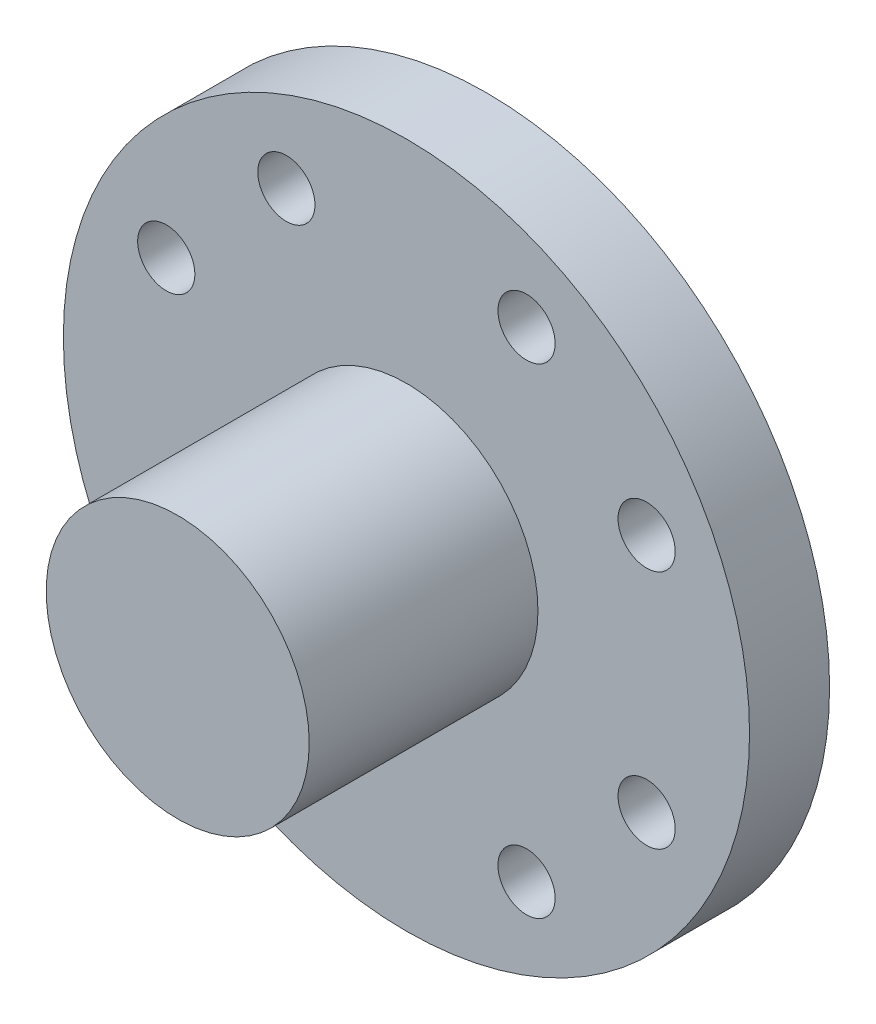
ISO-10303-21;
HEADER;
FILE_DESCRIPTION(('STEP AP214'),'2;1');
FILE_NAME('part.step','',(''),(''),'','','');
FILE_SCHEMA(('AUTOMOTIVE_DESIGN { 1 0 10303 214 1 1 1 1 }'));
ENDSEC;
DATA;
#1=APPLICATION_CONTEXT('core data for automotive mechanical design processes');
#2=APPLICATION_PROTOCOL_DEFINITION('international standard','automotive_design',2000,#1);
#3=PRODUCT_CONTEXT('',#1,'mechanical');
#4=PRODUCT('Part','Part','',(#3));
#5=PRODUCT_RELATED_PRODUCT_CATEGORY('part','',(#4));
#6=PRODUCT_DEFINITION_FORMATION('','',#4);
#7=PRODUCT_DEFINITION_CONTEXT('part definition',#1,'design');
#8=PRODUCT_DEFINITION('design','',#6,#7);
#9=PRODUCT_DEFINITION_SHAPE('','',#8);
#10=(LENGTH_UNIT() NAMED_UNIT(*) SI_UNIT(.MILLI.,.METRE.));
#11=(NAMED_UNIT(*) PLANE_ANGLE_UNIT() SI_UNIT($,.RADIAN.));
#12=(NAMED_UNIT(*) SI_UNIT($,.STERADIAN.) SOLID_ANGLE_UNIT());
#13=UNCERTAINTY_MEASURE_WITH_UNIT(LENGTH_MEASURE(1.E-05),#10,'distance_accuracy_value','');
#14=(GEOMETRIC_REPRESENTATION_CONTEXT(3) GLOBAL_UNCERTAINTY_ASSIGNED_CONTEXT((#13)) GLOBAL_UNIT_ASSIGNED_CONTEXT((#10,
#11,#12)) REPRESENTATION_CONTEXT('',''));
#15=CARTESIAN_POINT('',(0.,0.,0.));
#16=DIRECTION('',(0.,0.,1.));
#17=DIRECTION('',(1.,0.,0.));
#18=AXIS2_PLACEMENT_3D('',#15,#16,#17);
#19=CARTESIAN_POINT('',(0.,0.,8.89));
#20=DIRECTION('',(0.,0.,-1.));
#21=DIRECTION('',(-1.,0.,0.));
#22=AXIS2_PLACEMENT_3D('',#19,#20,#21);
#23=CYLINDRICAL_SURFACE('',#22,38.1);
#24=CARTESIAN_POINT('',(0.,0.,8.89));
#25=DIRECTION('',(0.,0.,1.));
#26=DIRECTION('',(1.,0.,0.));
#27=AXIS2_PLACEMENT_3D('',#24,#25,#26);
#28=CIRCLE('',#27,38.1);
#29=CARTESIAN_POINT('',(38.1,0.,8.89));
#30=VERTEX_POINT('',#29);
#31=EDGE_CURVE('E38',#30,#30,#28,.T.);
#32=ORIENTED_EDGE('',*,*,#31,.F.);
#33=EDGE_LOOP('',(#32));
#34=FACE_BOUND('',#33,.T.);
#35=CARTESIAN_POINT('',(0.,0.,0.));
#36=DIRECTION('',(0.,0.,1.));
#37=DIRECTION('',(1.,0.,0.));
#38=AXIS2_PLACEMENT_3D('',#35,#36,#37);
#39=CIRCLE('',#38,38.1);
#40=CARTESIAN_POINT('',(38.1,0.,0.));
#41=VERTEX_POINT('',#40);
#42=EDGE_CURVE('E34',#41,#41,#39,.T.);
#43=ORIENTED_EDGE('',*,*,#42,.T.);
#44=EDGE_LOOP('',(#43));
#45=FACE_BOUND('',#44,.T.);
#46=ADVANCED_FACE('F31',(#34,#45),#23,.T.);
#47=CARTESIAN_POINT('',(0.,0.,8.89));
#48=DIRECTION('',(0.,0.,1.));
#49=DIRECTION('',(1.,0.,0.));
#50=AXIS2_PLACEMENT_3D('',#47,#48,#49);
#51=PLANE('',#50);
#52=CARTESIAN_POINT('',(-26.6699999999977,13.3349999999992,8.89));
#53=DIRECTION('',(0.,0.,1.));
#54=DIRECTION('',(1.,0.,0.));
#55=AXIS2_PLACEMENT_3D('',#52,#53,#54);
#56=CIRCLE('',#55,3.17500000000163);
#57=CARTESIAN_POINT('',(-23.4949999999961,13.3349999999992,8.89));
#58=VERTEX_POINT('',#57);
#59=EDGE_CURVE('E54',#58,#58,#56,.T.);
#60=ORIENTED_EDGE('',*,*,#59,.F.);
#61=EDGE_LOOP('',(#60));
#62=FACE_BOUND('',#61,.T.);
#63=CARTESIAN_POINT('',(-26.6699999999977,-13.3350000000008,8.89));
#64=DIRECTION('',(0.,0.,1.));
#65=DIRECTION('',(1.,0.,0.));
#66=AXIS2_PLACEMENT_3D('',#63,#64,#65);
#67=CIRCLE('',#66,3.17500000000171);
#68=CARTESIAN_POINT('',(-23.494999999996,-13.3350000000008,8.89));
#69=VERTEX_POINT('',#68);
#70=EDGE_CURVE('E60',#69,#69,#67,.T.);
#71=ORIENTED_EDGE('',*,*,#70,.F.);
#72=EDGE_LOOP('',(#71));
#73=FACE_BOUND('',#72,.T.);
#74=CARTESIAN_POINT('',(-13.334999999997,-26.6699999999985,8.89));
#75=DIRECTION('',(0.,0.,1.));
#76=DIRECTION('',(1.,0.,0.));
#77=AXIS2_PLACEMENT_3D('',#74,#75,#76);
#78=CIRCLE('',#77,3.1750000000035);
#79=CARTESIAN_POINT('',(-10.1599999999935,-26.6699999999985,8.89));
#80=VERTEX_POINT('',#79);
#81=EDGE_CURVE('E66',#80,#80,#78,.T.);
#82=ORIENTED_EDGE('',*,*,#81,.F.);
#83=EDGE_LOOP('',(#82));
#84=FACE_BOUND('',#83,.T.);
#85=CARTESIAN_POINT('',(13.335000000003,-26.6699999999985,8.89));
#86=DIRECTION('',(0.,0.,1.));
#87=DIRECTION('',(1.,0.,0.));
#88=AXIS2_PLACEMENT_3D('',#85,#86,#87);
#89=CIRCLE('',#88,3.17500000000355);
#90=CARTESIAN_POINT('',(16.5100000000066,-26.6699999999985,8.89));
#91=VERTEX_POINT('',#90);
#92=EDGE_CURVE('E72',#91,#91,#89,.T.);
#93=ORIENTED_EDGE('',*,*,#92,.F.);
#94=EDGE_LOOP('',(#93));
#95=FACE_BOUND('',#94,.T.);
#96=CARTESIAN_POINT('',(26.6700000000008,-13.3349999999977,8.89));
#97=DIRECTION('',(0.,0.,1.));
#98=DIRECTION('',(1.,0.,0.));
#99=AXIS2_PLACEMENT_3D('',#96,#97,#98);
#100=CIRCLE('',#99,3.17500000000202);
#101=CARTESIAN_POINT('',(29.8450000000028,-13.3349999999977,8.89));
#102=VERTEX_POINT('',#101);
#103=EDGE_CURVE('E78',#102,#102,#100,.T.);
#104=ORIENTED_EDGE('',*,*,#103,.F.);
#105=EDGE_LOOP('',(#104));
#106=FACE_BOUND('',#105,.T.);
#107=CARTESIAN_POINT('',(26.6700000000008,13.3350000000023,8.89));
#108=DIRECTION('',(0.,0.,1.));
#109=DIRECTION('',(1.,0.,0.));
#110=AXIS2_PLACEMENT_3D('',#107,#108,#109);
#111=CIRCLE('',#110,3.17500000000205);
#112=CARTESIAN_POINT('',(29.8450000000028,13.3350000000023,8.89));
#113=VERTEX_POINT('',#112);
#114=EDGE_CURVE('E84',#113,#113,#111,.T.);
#115=ORIENTED_EDGE('',*,*,#114,.F.);
#116=EDGE_LOOP('',(#115));
#117=FACE_BOUND('',#116,.T.);
#118=CARTESIAN_POINT('',(13.335,26.67,8.89));
#119=DIRECTION('',(0.,0.,1.));
#120=DIRECTION('',(1.,0.,0.));
#121=AXIS2_PLACEMENT_3D('',#118,#119,#120);
#122=CIRCLE('',#121,3.175);
#123=CARTESIAN_POINT('',(16.51,26.67,8.89));
#124=VERTEX_POINT('',#123);
#125=EDGE_CURVE('E90',#124,#124,#122,.T.);
#126=ORIENTED_EDGE('',*,*,#125,.F.);
#127=EDGE_LOOP('',(#126));
#128=FACE_BOUND('',#127,.T.);
#129=CARTESIAN_POINT('',(-13.335,26.67,8.89));
#130=DIRECTION('',(0.,0.,1.));
#131=DIRECTION('',(1.,0.,0.));
#132=AXIS2_PLACEMENT_3D('',#129,#130,#131);
#133=CIRCLE('',#132,3.175);
#134=CARTESIAN_POINT('',(-10.16,26.67,8.89));
#135=VERTEX_POINT('',#134);
#136=EDGE_CURVE('E48',#135,#135,#133,.T.);
#137=ORIENTED_EDGE('',*,*,#136,.F.);
#138=EDGE_LOOP('',(#137));
#139=FACE_BOUND('',#138,.T.);
#140=CARTESIAN_POINT('',(0.,0.,8.89));
#141=DIRECTION('',(0.,0.,1.));
#142=DIRECTION('',(1.,0.,0.));
#143=AXIS2_PLACEMENT_3D('',#140,#141,#142);
#144=CIRCLE('',#143,14.605);
#145=CARTESIAN_POINT('',(14.605,0.,8.89));
#146=VERTEX_POINT('',#145);
#147=EDGE_CURVE('E10',#146,#146,#144,.T.);
#148=ORIENTED_EDGE('',*,*,#147,.F.);
#149=EDGE_LOOP('',(#148));
#150=FACE_BOUND('',#149,.T.);
#151=ORIENTED_EDGE('',*,*,#31,.T.);
#152=EDGE_LOOP('',(#151));
#153=FACE_BOUND('',#152,.T.);
#154=ADVANCED_FACE('F107',(#62,#73,#84,#95,#106,#117,#128,#139,#150,#153),#51,.T.);
#155=CARTESIAN_POINT('',(0.,0.,0.));
#156=DIRECTION('',(0.,0.,1.));
#157=DIRECTION('',(1.,0.,0.));
#158=AXIS2_PLACEMENT_3D('',#155,#156,#157);
#159=PLANE('',#158);
#160=CARTESIAN_POINT('',(-26.6699999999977,13.3349999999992,0.));
#161=DIRECTION('',(0.,0.,1.));
#162=DIRECTION('',(1.,0.,0.));
#163=AXIS2_PLACEMENT_3D('',#160,#161,#162);
#164=CIRCLE('',#163,3.17500000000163);
#165=CARTESIAN_POINT('',(-23.4949999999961,13.3349999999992,0.));
#166=VERTEX_POINT('',#165);
#167=EDGE_CURVE('E57',#166,#166,#164,.T.);
#168=ORIENTED_EDGE('',*,*,#167,.T.);
#169=EDGE_LOOP('',(#168));
#170=FACE_BOUND('',#169,.T.);
#171=CARTESIAN_POINT('',(-26.6699999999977,-13.3350000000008,0.));
#172=DIRECTION('',(0.,0.,1.));
#173=DIRECTION('',(1.,0.,0.));
#174=AXIS2_PLACEMENT_3D('',#171,#172,#173);
#175=CIRCLE('',#174,3.17500000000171);
#176=CARTESIAN_POINT('',(-23.494999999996,-13.3350000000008,0.));
#177=VERTEX_POINT('',#176);
#178=EDGE_CURVE('E63',#177,#177,#175,.T.);
#179=ORIENTED_EDGE('',*,*,#178,.T.);
#180=EDGE_LOOP('',(#179));
#181=FACE_BOUND('',#180,.T.);
#182=CARTESIAN_POINT('',(-13.334999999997,-26.6699999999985,0.));
#183=DIRECTION('',(0.,0.,1.));
#184=DIRECTION('',(1.,0.,0.));
#185=AXIS2_PLACEMENT_3D('',#182,#183,#184);
#186=CIRCLE('',#185,3.1750000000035);
#187=CARTESIAN_POINT('',(-10.1599999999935,-26.6699999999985,0.));
#188=VERTEX_POINT('',#187);
#189=EDGE_CURVE('E69',#188,#188,#186,.T.);
#190=ORIENTED_EDGE('',*,*,#189,.T.);
#191=EDGE_LOOP('',(#190));
#192=FACE_BOUND('',#191,.T.);
#193=CARTESIAN_POINT('',(13.335000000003,-26.6699999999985,0.));
#194=DIRECTION('',(0.,0.,1.));
#195=DIRECTION('',(1.,0.,0.));
#196=AXIS2_PLACEMENT_3D('',#193,#194,#195);
#197=CIRCLE('',#196,3.17500000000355);
#198=CARTESIAN_POINT('',(16.5100000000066,-26.6699999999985,0.));
#199=VERTEX_POINT('',#198);
#200=EDGE_CURVE('E75',#199,#199,#197,.T.);
#201=ORIENTED_EDGE('',*,*,#200,.T.);
#202=EDGE_LOOP('',(#201));
#203=FACE_BOUND('',#202,.T.);
#204=CARTESIAN_POINT('',(26.6700000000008,-13.3349999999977,0.));
#205=DIRECTION('',(0.,0.,1.));
#206=DIRECTION('',(1.,0.,0.));
#207=AXIS2_PLACEMENT_3D('',#204,#205,#206);
#208=CIRCLE('',#207,3.17500000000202);
#209=CARTESIAN_POINT('',(29.8450000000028,-13.3349999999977,0.));
#210=VERTEX_POINT('',#209);
#211=EDGE_CURVE('E81',#210,#210,#208,.T.);
#212=ORIENTED_EDGE('',*,*,#211,.T.);
#213=EDGE_LOOP('',(#212));
#214=FACE_BOUND('',#213,.T.);
#215=CARTESIAN_POINT('',(26.6700000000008,13.3350000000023,0.));
#216=DIRECTION('',(0.,0.,1.));
#217=DIRECTION('',(1.,0.,0.));
#218=AXIS2_PLACEMENT_3D('',#215,#216,#217);
#219=CIRCLE('',#218,3.17500000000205);
#220=CARTESIAN_POINT('',(29.8450000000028,13.3350000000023,0.));
#221=VERTEX_POINT('',#220);
#222=EDGE_CURVE('E87',#221,#221,#219,.T.);
#223=ORIENTED_EDGE('',*,*,#222,.T.);
#224=EDGE_LOOP('',(#223));
#225=FACE_BOUND('',#224,.T.);
#226=CARTESIAN_POINT('',(13.335,26.67,0.));
#227=DIRECTION('',(0.,0.,1.));
#228=DIRECTION('',(1.,0.,0.));
#229=AXIS2_PLACEMENT_3D('',#226,#227,#228);
#230=CIRCLE('',#229,3.175);
#231=CARTESIAN_POINT('',(16.51,26.67,0.));
#232=VERTEX_POINT('',#231);
#233=EDGE_CURVE('E51',#232,#232,#230,.T.);
#234=ORIENTED_EDGE('',*,*,#233,.T.);
#235=EDGE_LOOP('',(#234));
#236=FACE_BOUND('',#235,.T.);
#237=CARTESIAN_POINT('',(-13.335,26.67,0.));
#238=DIRECTION('',(0.,0.,1.));
#239=DIRECTION('',(1.,0.,0.));
#240=AXIS2_PLACEMENT_3D('',#237,#238,#239);
#241=CIRCLE('',#240,3.175);
#242=CARTESIAN_POINT('',(-10.16,26.67,0.));
#243=VERTEX_POINT('',#242);
#244=EDGE_CURVE('E47',#243,#243,#241,.T.);
#245=ORIENTED_EDGE('',*,*,#244,.T.);
#246=EDGE_LOOP('',(#245));
#247=FACE_BOUND('',#246,.T.);
#248=ORIENTED_EDGE('',*,*,#42,.F.);
#249=EDGE_LOOP('',(#248));
#250=FACE_BOUND('',#249,.T.);
#251=ADVANCED_FACE('F96',(#170,#181,#192,#203,#214,#225,#236,#247,#250),#159,.F.);
#252=CARTESIAN_POINT('',(0.,0.,34.29));
#253=DIRECTION('',(0.,0.,-1.));
#254=DIRECTION('',(-1.,0.,0.));
#255=AXIS2_PLACEMENT_3D('',#252,#253,#254);
#256=CYLINDRICAL_SURFACE('',#255,14.605);
#257=CARTESIAN_POINT('',(0.,0.,34.29));
#258=DIRECTION('',(0.,0.,1.));
#259=DIRECTION('',(1.,0.,0.));
#260=AXIS2_PLACEMENT_3D('',#257,#258,#259);
#261=CIRCLE('',#260,14.605);
#262=CARTESIAN_POINT('',(14.605,0.,34.29));
#263=VERTEX_POINT('',#262);
#264=EDGE_CURVE('E44',#263,#263,#261,.T.);
#265=ORIENTED_EDGE('',*,*,#264,.F.);
#266=EDGE_LOOP('',(#265));
#267=FACE_BOUND('',#266,.T.);
#268=ORIENTED_EDGE('',*,*,#147,.T.);
#269=EDGE_LOOP('',(#268));
#270=FACE_BOUND('',#269,.T.);
#271=ADVANCED_FACE('F123',(#267,#270),#256,.T.);
#272=CARTESIAN_POINT('',(0.,0.,34.29));
#273=DIRECTION('',(0.,0.,1.));
#274=DIRECTION('',(1.,0.,0.));
#275=AXIS2_PLACEMENT_3D('',#272,#273,#274);
#276=PLANE('',#275);
#277=ORIENTED_EDGE('',*,*,#264,.T.);
#278=EDGE_LOOP('',(#277));
#279=FACE_BOUND('',#278,.T.);
#280=ADVANCED_FACE('F128',(#279),#276,.T.);
#281=CARTESIAN_POINT('',(-13.335,26.67,0.));
#282=DIRECTION('',(0.,0.,1.));
#283=DIRECTION('',(1.,0.,0.));
#284=AXIS2_PLACEMENT_3D('',#281,#282,#283);
#285=CYLINDRICAL_SURFACE('',#284,3.175);
#286=ORIENTED_EDGE('',*,*,#244,.F.);
#287=EDGE_LOOP('',(#286));
#288=FACE_BOUND('',#287,.T.);
#289=ORIENTED_EDGE('',*,*,#136,.T.);
#290=EDGE_LOOP('',(#289));
#291=FACE_BOUND('',#290,.T.);
#292=ADVANCED_FACE('F103',(#288,#291),#285,.F.);
#293=CARTESIAN_POINT('',(13.335,26.67,0.));
#294=DIRECTION('',(0.,0.,1.));
#295=DIRECTION('',(1.,0.,0.));
#296=AXIS2_PLACEMENT_3D('',#293,#294,#295);
#297=CYLINDRICAL_SURFACE('',#296,3.175);
#298=ORIENTED_EDGE('',*,*,#233,.F.);
#299=EDGE_LOOP('',(#298));
#300=FACE_BOUND('',#299,.T.);
#301=ORIENTED_EDGE('',*,*,#125,.T.);
#302=EDGE_LOOP('',(#301));
#303=FACE_BOUND('',#302,.T.);
#304=ADVANCED_FACE('F99',(#300,#303),#297,.F.);
#305=CARTESIAN_POINT('',(26.6700000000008,13.3350000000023,0.));
#306=DIRECTION('',(0.,0.,1.));
#307=DIRECTION('',(1.,0.,0.));
#308=AXIS2_PLACEMENT_3D('',#305,#306,#307);
#309=CYLINDRICAL_SURFACE('',#308,3.17500000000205);
#310=ORIENTED_EDGE('',*,*,#222,.F.);
#311=EDGE_LOOP('',(#310));
#312=FACE_BOUND('',#311,.T.);
#313=ORIENTED_EDGE('',*,*,#114,.T.);
#314=EDGE_LOOP('',(#313));
#315=FACE_BOUND('',#314,.T.);
#316=ADVANCED_FACE('F102',(#312,#315),#309,.F.);
#317=CARTESIAN_POINT('',(26.6700000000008,-13.3349999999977,0.));
#318=DIRECTION('',(0.,0.,1.));
#319=DIRECTION('',(1.,0.,0.));
#320=AXIS2_PLACEMENT_3D('',#317,#318,#319);
#321=CYLINDRICAL_SURFACE('',#320,3.17500000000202);
#322=ORIENTED_EDGE('',*,*,#211,.F.);
#323=EDGE_LOOP('',(#322));
#324=FACE_BOUND('',#323,.T.);
#325=ORIENTED_EDGE('',*,*,#103,.T.);
#326=EDGE_LOOP('',(#325));
#327=FACE_BOUND('',#326,.T.);
#328=ADVANCED_FACE('F154',(#324,#327),#321,.F.);
#329=CARTESIAN_POINT('',(13.335000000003,-26.6699999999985,0.));
#330=DIRECTION('',(0.,0.,1.));
#331=DIRECTION('',(1.,0.,0.));
#332=AXIS2_PLACEMENT_3D('',#329,#330,#331);
#333=CYLINDRICAL_SURFACE('',#332,3.17500000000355);
#334=ORIENTED_EDGE('',*,*,#200,.F.);
#335=EDGE_LOOP('',(#334));
#336=FACE_BOUND('',#335,.T.);
#337=ORIENTED_EDGE('',*,*,#92,.T.);
#338=EDGE_LOOP('',(#337));
#339=FACE_BOUND('',#338,.T.);
#340=ADVANCED_FACE('F150',(#336,#339),#333,.F.);
#341=CARTESIAN_POINT('',(-13.334999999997,-26.6699999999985,0.));
#342=DIRECTION('',(0.,0.,1.));
#343=DIRECTION('',(1.,0.,0.));
#344=AXIS2_PLACEMENT_3D('',#341,#342,#343);
#345=CYLINDRICAL_SURFACE('',#344,3.1750000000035);
#346=ORIENTED_EDGE('',*,*,#189,.F.);
#347=EDGE_LOOP('',(#346));
#348=FACE_BOUND('',#347,.T.);
#349=ORIENTED_EDGE('',*,*,#81,.T.);
#350=EDGE_LOOP('',(#349));
#351=FACE_BOUND('',#350,.T.);
#352=ADVANCED_FACE('F146',(#348,#351),#345,.F.);
#353=CARTESIAN_POINT('',(-26.6699999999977,-13.3350000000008,0.));
#354=DIRECTION('',(0.,0.,1.));
#355=DIRECTION('',(1.,0.,0.));
#356=AXIS2_PLACEMENT_3D('',#353,#354,#355);
#357=CYLINDRICAL_SURFACE('',#356,3.17500000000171);
#358=ORIENTED_EDGE('',*,*,#178,.F.);
#359=EDGE_LOOP('',(#358));
#360=FACE_BOUND('',#359,.T.);
#361=ORIENTED_EDGE('',*,*,#70,.T.);
#362=EDGE_LOOP('',(#361));
#363=FACE_BOUND('',#362,.T.);
#364=ADVANCED_FACE('F142',(#360,#363),#357,.F.);
#365=CARTESIAN_POINT('',(-26.6699999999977,13.3349999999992,0.));
#366=DIRECTION('',(0.,0.,1.));
#367=DIRECTION('',(1.,0.,0.));
#368=AXIS2_PLACEMENT_3D('',#365,#366,#367);
#369=CYLINDRICAL_SURFACE('',#368,3.17500000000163);
#370=ORIENTED_EDGE('',*,*,#167,.F.);
#371=EDGE_LOOP('',(#370));
#372=FACE_BOUND('',#371,.T.);
#373=ORIENTED_EDGE('',*,*,#59,.T.);
#374=EDGE_LOOP('',(#373));
#375=FACE_BOUND('',#374,.T.);
#376=ADVANCED_FACE('F139',(#372,#375),#369,.F.);
#377=CLOSED_SHELL('',(#46,#154,#251,#271,#280,#292,#304,#316,#328,#340,#352,#364,#376));
#378=MANIFOLD_SOLID_BREP('B2',#377);
#379=ADVANCED_BREP_SHAPE_REPRESENTATION('',(#18,#378),#14);
#380=SHAPE_DEFINITION_REPRESENTATION(#9,#379);
ENDSEC;
END-ISO-10303-21;
